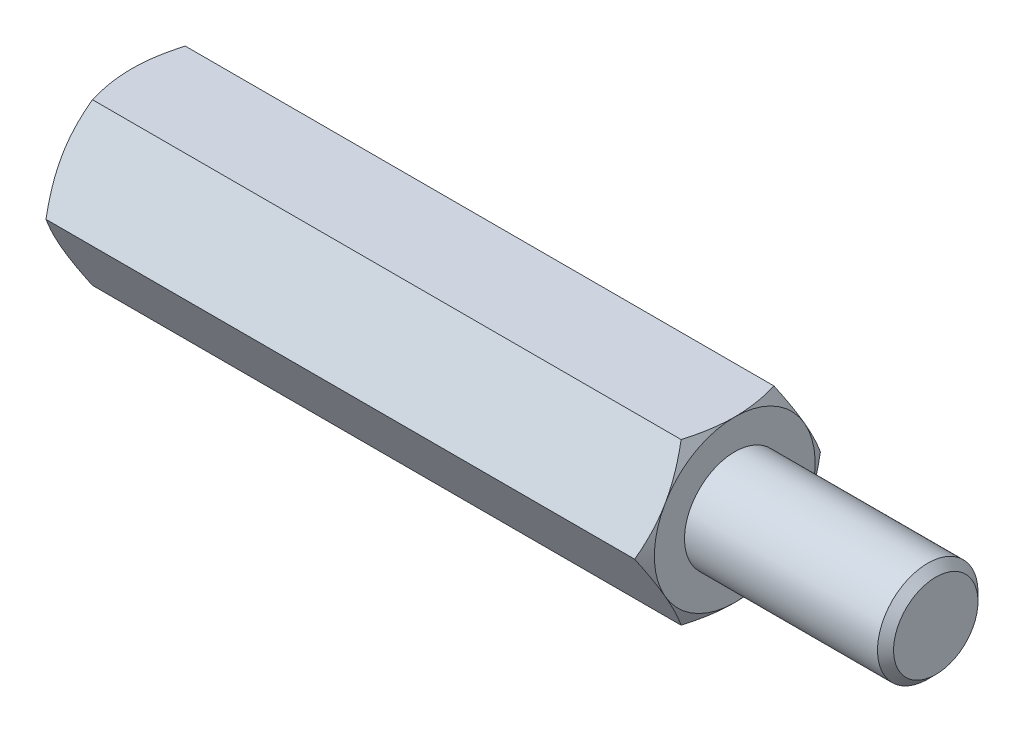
ISO-10303-21;
HEADER;
FILE_DESCRIPTION(('STEP AP214'),'2;1');
FILE_NAME('part.step','',(''),(''),'','','');
FILE_SCHEMA(('AUTOMOTIVE_DESIGN { 1 0 10303 214 1 1 1 1 }'));
ENDSEC;
DATA;
#1=APPLICATION_CONTEXT('core data for automotive mechanical design processes');
#2=APPLICATION_PROTOCOL_DEFINITION('international standard','automotive_design',2000,#1);
#3=PRODUCT_CONTEXT('',#1,'mechanical');
#4=PRODUCT('Part','Part','',(#3));
#5=PRODUCT_RELATED_PRODUCT_CATEGORY('part','',(#4));
#6=PRODUCT_DEFINITION_FORMATION('','',#4);
#7=PRODUCT_DEFINITION_CONTEXT('part definition',#1,'design');
#8=PRODUCT_DEFINITION('design','',#6,#7);
#9=PRODUCT_DEFINITION_SHAPE('','',#8);
#10=(LENGTH_UNIT() NAMED_UNIT(*) SI_UNIT(.MILLI.,.METRE.));
#11=(NAMED_UNIT(*) PLANE_ANGLE_UNIT() SI_UNIT($,.RADIAN.));
#12=(NAMED_UNIT(*) SI_UNIT($,.STERADIAN.) SOLID_ANGLE_UNIT());
#13=UNCERTAINTY_MEASURE_WITH_UNIT(LENGTH_MEASURE(1.E-05),#10,'distance_accuracy_value','');
#14=(GEOMETRIC_REPRESENTATION_CONTEXT(3) GLOBAL_UNCERTAINTY_ASSIGNED_CONTEXT((#13)) GLOBAL_UNIT_ASSIGNED_CONTEXT((#10,
#11,#12)) REPRESENTATION_CONTEXT('',''));
#15=CARTESIAN_POINT('',(0.,0.,0.));
#16=DIRECTION('',(0.,0.,1.));
#17=DIRECTION('',(1.,0.,0.));
#18=AXIS2_PLACEMENT_3D('',#15,#16,#17);
#19=CARTESIAN_POINT('',(15.,4.,-2.3094010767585));
#20=DIRECTION('',(1.,0.,0.));
#21=DIRECTION('',(0.,0.,-1.));
#22=AXIS2_PLACEMENT_3D('',#19,#20,#21);
#23=PLANE('',#22);
#24=CARTESIAN_POINT('',(15.,0.,0.));
#25=DIRECTION('',(1.,0.,0.));
#26=DIRECTION('',(0.,0.,-1.));
#27=AXIS2_PLACEMENT_3D('',#24,#25,#26);
#28=CIRCLE('',#27,4.);
#29=CARTESIAN_POINT('',(15.,-2.,-3.46410161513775));
#30=VERTEX_POINT('',#29);
#31=CARTESIAN_POINT('',(15.,2.,-3.46410161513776));
#32=VERTEX_POINT('',#31);
#33=EDGE_CURVE('E288',#30,#32,#28,.T.);
#34=ORIENTED_EDGE('',*,*,#33,.T.);
#35=CARTESIAN_POINT('',(15.,4.,0.));
#36=VERTEX_POINT('',#35);
#37=EDGE_CURVE('E53',#32,#36,#28,.T.);
#38=ORIENTED_EDGE('',*,*,#37,.T.);
#39=CARTESIAN_POINT('',(15.,2.,3.46410161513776));
#40=VERTEX_POINT('',#39);
#41=EDGE_CURVE('E297',#36,#40,#28,.T.);
#42=ORIENTED_EDGE('',*,*,#41,.T.);
#43=CARTESIAN_POINT('',(15.,-2.,3.46410161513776));
#44=VERTEX_POINT('',#43);
#45=EDGE_CURVE('E303',#40,#44,#28,.T.);
#46=ORIENTED_EDGE('',*,*,#45,.T.);
#47=CARTESIAN_POINT('',(15.,0.,0.));
#48=DIRECTION('',(-1.,0.,0.));
#49=DIRECTION('',(0.,-1.,0.));
#50=AXIS2_PLACEMENT_3D('',#47,#48,#49);
#51=CIRCLE('',#50,4.);
#52=CARTESIAN_POINT('',(15.,-4.00000000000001,0.));
#53=VERTEX_POINT('',#52);
#54=EDGE_CURVE('E193',#53,#44,#51,.T.);
#55=ORIENTED_EDGE('',*,*,#54,.F.);
#56=EDGE_CURVE('E61',#53,#30,#28,.T.);
#57=ORIENTED_EDGE('',*,*,#56,.T.);
#58=EDGE_LOOP('',(#34,#38,#42,#46,#55,#57));
#59=FACE_BOUND('',#58,.T.);
#60=CARTESIAN_POINT('',(15.,0.,0.));
#61=DIRECTION('',(1.,0.,0.));
#62=DIRECTION('',(0.,0.,-1.));
#63=AXIS2_PLACEMENT_3D('',#60,#61,#62);
#64=CIRCLE('',#63,2.5);
#65=CARTESIAN_POINT('',(15.,0.,-2.5));
#66=VERTEX_POINT('',#65);
#67=EDGE_CURVE('E506',#66,#66,#64,.T.);
#68=ORIENTED_EDGE('',*,*,#67,.F.);
#69=EDGE_LOOP('',(#68));
#70=FACE_BOUND('',#69,.T.);
#71=ADVANCED_FACE('F37',(#59,#70),#23,.T.);
#72=CARTESIAN_POINT('',(15.,0.,-4.61880215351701));
#73=DIRECTION('',(0.,-0.5,0.866025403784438));
#74=DIRECTION('',(0.,-0.866025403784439,-0.5));
#75=AXIS2_PLACEMENT_3D('',#72,#73,#74);
#76=PLANE('',#75);
#77=CARTESIAN_POINT('',(14.6426677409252,-0.000200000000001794,-4.61891762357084));
#78=CARTESIAN_POINT('',(14.7012821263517,0.175579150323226,-4.5174314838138));
#79=CARTESIAN_POINT('',(14.7545896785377,0.352875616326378,-4.41506932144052));
#80=CARTESIAN_POINT('',(14.8476383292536,0.710538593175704,-4.2085725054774));
#81=CARTESIAN_POINT('',(14.8873465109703,0.890911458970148,-4.10443418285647));
#82=CARTESIAN_POINT('',(14.9491577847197,1.24942181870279,-3.89744813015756));
#83=CARTESIAN_POINT('',(14.9716722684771,1.42750415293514,-3.79463224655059));
#84=CARTESIAN_POINT('',(14.9985493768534,1.7845067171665,-3.58851671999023));
#85=CARTESIAN_POINT('',(15.0029342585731,1.9634256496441,-3.48521782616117));
#86=CARTESIAN_POINT('',(14.99380992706,2.29774284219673,-3.29219970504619));
#87=CARTESIAN_POINT('',(14.982541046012,2.45319115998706,-3.20245157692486));
#88=CARTESIAN_POINT('',(14.9468260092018,2.76307505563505,-3.02354002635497));
#89=CARTESIAN_POINT('',(14.9223676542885,2.91750956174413,-2.93437722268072));
#90=CARTESIAN_POINT('',(14.8612239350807,3.22803232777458,-2.75509682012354));
#91=CARTESIAN_POINT('',(14.8242793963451,3.3840812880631,-2.6650019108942));
#92=CARTESIAN_POINT('',(14.740429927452,3.69385183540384,-2.48615580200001));
#93=CARTESIAN_POINT('',(14.6935446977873,3.84757739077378,-2.39740231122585));
#94=CARTESIAN_POINT('',(14.6426677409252,4.0002,-2.30928560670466));
#95=B_SPLINE_CURVE_WITH_KNOTS('',3,(#77,#78,#79,#80,#81,#82,#83,#84,#85,#86,#87,#88,#89,#90,#91,
#92,#93,#94),.UNSPECIFIED.,.F.,.F.,(4,2,2,2,2,2,2,2,4),(0.,0.634047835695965,1.26961969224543,
1.88946157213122,2.50854226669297,3.04757825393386,3.58711366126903,4.13861653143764,
4.68903648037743),.UNSPECIFIED.);
#96=CARTESIAN_POINT('',(14.6427344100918,0.,-4.61880215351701));
#97=VERTEX_POINT('',#96);
#98=EDGE_CURVE('E313',#97,#32,#95,.T.);
#99=ORIENTED_EDGE('',*,*,#98,.F.);
#100=DIRECTION('',(-1.,0.,0.));
#101=VECTOR('',#100,1.);
#102=CARTESIAN_POINT('',(15.,0.,-4.61880215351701));
#103=LINE('',#102,#101);
#104=CARTESIAN_POINT('',(-14.6427344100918,0.,-4.61880215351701));
#105=VERTEX_POINT('',#104);
#106=EDGE_CURVE('E264',#97,#105,#103,.T.);
#107=ORIENTED_EDGE('',*,*,#106,.T.);
#108=CARTESIAN_POINT('',(-14.6426677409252,4.0002,-2.30928560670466));
#109=CARTESIAN_POINT('',(-14.7012821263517,3.82442084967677,-2.4107717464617));
#110=CARTESIAN_POINT('',(-14.7545896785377,3.64712438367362,-2.51313390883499));
#111=CARTESIAN_POINT('',(-14.8476383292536,3.28946140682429,-2.71963072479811));
#112=CARTESIAN_POINT('',(-14.8873465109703,3.10908854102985,-2.82376904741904));
#113=CARTESIAN_POINT('',(-14.9491577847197,2.75057818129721,-3.03075510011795));
#114=CARTESIAN_POINT('',(-14.9716722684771,2.57249584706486,-3.13357098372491));
#115=CARTESIAN_POINT('',(-14.9985493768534,2.21549328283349,-3.33968651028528));
#116=CARTESIAN_POINT('',(-15.0029342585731,2.0365743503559,-3.44298540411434));
#117=CARTESIAN_POINT('',(-14.99380992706,1.70225715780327,-3.63600352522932));
#118=CARTESIAN_POINT('',(-14.982541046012,1.54680884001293,-3.72575165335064));
#119=CARTESIAN_POINT('',(-14.9468260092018,1.23692494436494,-3.90466320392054));
#120=CARTESIAN_POINT('',(-14.9223676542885,1.08249043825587,-3.99382600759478));
#121=CARTESIAN_POINT('',(-14.8612239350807,0.771967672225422,-4.17310641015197));
#122=CARTESIAN_POINT('',(-14.8242793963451,0.615918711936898,-4.26320131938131));
#123=CARTESIAN_POINT('',(-14.740429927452,0.30614816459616,-4.4420474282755));
#124=CARTESIAN_POINT('',(-14.6935446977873,0.15242260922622,-4.53080091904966));
#125=CARTESIAN_POINT('',(-14.6426677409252,-0.000200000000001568,-4.61891762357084));
#126=B_SPLINE_CURVE_WITH_KNOTS('',3,(#108,#109,#110,#111,#112,#113,#114,#115,#116,#117,#118,
#119,#120,#121,#122,#123,#124,#125),.UNSPECIFIED.,.F.,.F.,(4,2,2,2,2,2,2,2,4),(0.,
0.634047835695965,1.26961969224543,1.88946157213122,2.50854226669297,3.04757825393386,
3.58711366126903,4.13861653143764,4.68903648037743),.UNSPECIFIED.);
#127=CARTESIAN_POINT('',(-15.,2.,-3.46410161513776));
#128=VERTEX_POINT('',#127);
#129=EDGE_CURVE('E330',#128,#105,#126,.T.);
#130=ORIENTED_EDGE('',*,*,#129,.F.);
#131=CARTESIAN_POINT('',(-14.6427344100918,4.,-2.3094010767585));
#132=VERTEX_POINT('',#131);
#133=EDGE_CURVE('E324',#132,#128,#126,.T.);
#134=ORIENTED_EDGE('',*,*,#133,.F.);
#135=DIRECTION('',(-1.,0.,0.));
#136=VECTOR('',#135,1.);
#137=CARTESIAN_POINT('',(15.,4.,-2.3094010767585));
#138=LINE('',#137,#136);
#139=CARTESIAN_POINT('',(14.642734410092,4.,-2.30940107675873));
#140=VERTEX_POINT('',#139);
#141=EDGE_CURVE('E279',#140,#132,#138,.T.);
#142=ORIENTED_EDGE('',*,*,#141,.F.);
#143=EDGE_CURVE('E229',#32,#140,#95,.T.);
#144=ORIENTED_EDGE('',*,*,#143,.F.);
#145=EDGE_LOOP('',(#99,#107,#130,#134,#142,#144));
#146=FACE_BOUND('',#145,.T.);
#147=ADVANCED_FACE('F148',(#146),#76,.F.);
#148=CARTESIAN_POINT('',(15.,4.,-2.3094010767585));
#149=DIRECTION('',(0.,-1.,0.));
#150=DIRECTION('',(0.,0.,-1.));
#151=AXIS2_PLACEMENT_3D('',#148,#149,#150);
#152=PLANE('',#151);
#153=CARTESIAN_POINT('',(13.0082907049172,4.,-6.28479524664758));
#154=CARTESIAN_POINT('',(13.0937006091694,4.,-6.10939349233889));
#155=CARTESIAN_POINT('',(13.1783148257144,4.,-5.93359774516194));
#156=CARTESIAN_POINT('',(13.3455059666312,4.,-5.58100905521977));
#157=CARTESIAN_POINT('',(13.4280825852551,4.,-5.40421596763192));
#158=CARTESIAN_POINT('',(13.5911508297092,4.,-5.04855089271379));
#159=CARTESIAN_POINT('',(13.6716293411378,4.,-4.86967287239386));
#160=CARTESIAN_POINT('',(13.829400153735,4.,-4.51052237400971));
#161=CARTESIAN_POINT('',(13.906692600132,4.,-4.33024995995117));
#162=CARTESIAN_POINT('',(14.059802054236,4.,-3.96189114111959));
#163=CARTESIAN_POINT('',(14.135480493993,4.,-3.77374683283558));
#164=CARTESIAN_POINT('',(14.2813045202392,4.,-3.39528725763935));
#165=CARTESIAN_POINT('',(14.3514494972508,4.,-3.2049717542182));
#166=CARTESIAN_POINT('',(14.4844245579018,4.,-2.82219775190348));
#167=CARTESIAN_POINT('',(14.5472687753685,4.,-2.62974421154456));
#168=CARTESIAN_POINT('',(14.6636796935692,4.,-2.24207725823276));
#169=CARTESIAN_POINT('',(14.7172492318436,4.,-2.04686470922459));
#170=CARTESIAN_POINT('',(14.8123031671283,4.,-1.65467425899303));
#171=CARTESIAN_POINT('',(14.8538563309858,4.,-1.45771333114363));
#172=CARTESIAN_POINT('',(14.9225903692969,4.,-1.06125849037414));
#173=CARTESIAN_POINT('',(14.9497727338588,4.,-0.861764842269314));
#174=CARTESIAN_POINT('',(14.9872447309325,4.,-0.46387918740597));
#175=CARTESIAN_POINT('',(14.9977578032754,4.,-0.265508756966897));
#176=CARTESIAN_POINT('',(15.0015934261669,4.,0.131417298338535));
#177=CARTESIAN_POINT('',(14.9949158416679,4.,0.329972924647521));
#178=CARTESIAN_POINT('',(14.9696489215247,4.,0.664692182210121));
#179=CARTESIAN_POINT('',(14.9553708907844,4.,0.801202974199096));
#180=CARTESIAN_POINT('',(14.9195349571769,4.,1.07327201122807));
#181=CARTESIAN_POINT('',(14.8979761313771,4.,1.20883013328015));
#182=CARTESIAN_POINT('',(14.8235066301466,4.,1.61386939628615));
#183=CARTESIAN_POINT('',(14.7608149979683,4.,1.88157484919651));
#184=CARTESIAN_POINT('',(14.6515117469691,4.,2.28197262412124));
#185=CARTESIAN_POINT('',(14.612009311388,4.,2.41672443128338));
#186=CARTESIAN_POINT('',(14.5287523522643,4.,2.68492067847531));
#187=CARTESIAN_POINT('',(14.4849977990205,4.,2.81836510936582));
#188=CARTESIAN_POINT('',(14.3939510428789,4.,3.0839859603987));
#189=CARTESIAN_POINT('',(14.346659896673,4.,3.21616274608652));
#190=CARTESIAN_POINT('',(14.2491111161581,4.,3.47941134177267));
#191=CARTESIAN_POINT('',(14.1988535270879,4.,3.61048316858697));
#192=CARTESIAN_POINT('',(14.0713295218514,4.,3.93385125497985));
#193=CARTESIAN_POINT('',(13.9926014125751,4.,4.12557021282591));
#194=CARTESIAN_POINT('',(13.8309693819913,4.,4.50724553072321));
#195=CARTESIAN_POINT('',(13.7480651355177,4.,4.69720175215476));
#196=CARTESIAN_POINT('',(13.5789699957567,4.,5.07569950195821));
#197=CARTESIAN_POINT('',(13.4927782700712,4.,5.26424065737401));
#198=CARTESIAN_POINT('',(13.3178011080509,4.,5.64011758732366));
#199=CARTESIAN_POINT('',(13.2290156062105,4.,5.82745333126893));
#200=CARTESIAN_POINT('',(12.9593432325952,4.,6.38844423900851));
#201=CARTESIAN_POINT('',(12.7753561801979,4.,6.76060781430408));
#202=CARTESIAN_POINT('',(12.4019562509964,4.,7.50211228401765));
#203=CARTESIAN_POINT('',(12.2125442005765,4.,7.87145359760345));
#204=CARTESIAN_POINT('',(11.8473877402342,4.,8.57450173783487));
#205=CARTESIAN_POINT('',(11.671975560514,4.,8.90838144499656));
#206=CARTESIAN_POINT('',(11.3188097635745,4.,9.57491712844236));
#207=CARTESIAN_POINT('',(11.1410560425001,4.,9.90757304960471));
#208=CARTESIAN_POINT('',(10.7842933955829,4.,10.5709822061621));
#209=CARTESIAN_POINT('',(10.6052895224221,3.99999999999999,10.9017381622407));
#210=CARTESIAN_POINT('',(10.2459071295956,3.99999999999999,11.5624752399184));
#211=CARTESIAN_POINT('',(10.0655286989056,3.99999999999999,11.8924564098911));
#212=CARTESIAN_POINT('',(9.88464248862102,3.99999999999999,12.2221569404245));
#213=B_SPLINE_CURVE_WITH_KNOTS('',3,(#153,#154,#155,#156,#157,#158,#159,#160,#161,#162,#163,
#164,#165,#166,#167,#168,#169,#170,#171,#172,#173,#174,#175,#176,#177,#178,#179,#180,#181,#182,
#183,#184,#185,#186,#187,#188,#189,#190,#191,#192,#193,#194,#195,#196,#197,#198,#199,#200,#201,
#202,#203,#204,#205,#206,#207,#208,#209,#210,#211,#212),.UNSPECIFIED.,.F.,.F.,(4,2,2,2,2,2,2,2,
2,2,2,2,2,2,2,2,2,2,2,2,2,2,2,2,2,2,2,2,2,4),(0.,0.585280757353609,1.17064881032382,
1.75906864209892,2.34746162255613,2.9557770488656,3.56415938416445,4.17134357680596,
4.77834167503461,5.38179402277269,5.98518378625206,6.58041501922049,7.17565092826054,
7.5872191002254,7.99883946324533,8.82250155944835,9.24373134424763,9.66496407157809,
10.086071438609,10.5071723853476,11.1288656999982,11.7506074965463,12.3725077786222,
12.9944237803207,14.2398211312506,15.4850297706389,16.6164791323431,17.7479788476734,
18.8762380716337,20.0044248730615),.UNSPECIFIED.);
#214=EDGE_CURVE('E227',#140,#36,#213,.T.);
#215=ORIENTED_EDGE('',*,*,#214,.F.);
#216=ORIENTED_EDGE('',*,*,#141,.T.);
#217=CARTESIAN_POINT('',(-13.0082907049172,4.,-6.28479524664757));
#218=CARTESIAN_POINT('',(-13.0937006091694,4.,-6.10939349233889));
#219=CARTESIAN_POINT('',(-13.1783148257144,4.,-5.93359774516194));
#220=CARTESIAN_POINT('',(-13.3455059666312,4.,-5.58100905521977));
#221=CARTESIAN_POINT('',(-13.4280825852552,4.,-5.40421596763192));
#222=CARTESIAN_POINT('',(-13.5911508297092,4.,-5.04855089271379));
#223=CARTESIAN_POINT('',(-13.6716293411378,4.,-4.86967287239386));
#224=CARTESIAN_POINT('',(-13.829400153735,4.,-4.51052237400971));
#225=CARTESIAN_POINT('',(-13.906692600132,4.,-4.33024995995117));
#226=CARTESIAN_POINT('',(-14.059802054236,4.,-3.96189114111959));
#227=CARTESIAN_POINT('',(-14.135480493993,4.,-3.77374683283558));
#228=CARTESIAN_POINT('',(-14.2813045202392,4.,-3.39528725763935));
#229=CARTESIAN_POINT('',(-14.3514494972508,4.,-3.2049717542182));
#230=CARTESIAN_POINT('',(-14.4844245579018,4.,-2.82219775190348));
#231=CARTESIAN_POINT('',(-14.5472687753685,4.,-2.62974421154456));
#232=CARTESIAN_POINT('',(-14.6636796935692,4.,-2.24207725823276));
#233=CARTESIAN_POINT('',(-14.7172492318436,4.,-2.04686470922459));
#234=CARTESIAN_POINT('',(-14.8123031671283,4.,-1.65467425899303));
#235=CARTESIAN_POINT('',(-14.8538563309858,4.,-1.45771333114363));
#236=CARTESIAN_POINT('',(-14.9225903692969,4.,-1.06125849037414));
#237=CARTESIAN_POINT('',(-14.9497727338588,4.,-0.861764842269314));
#238=CARTESIAN_POINT('',(-14.9872447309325,4.,-0.46387918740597));
#239=CARTESIAN_POINT('',(-14.9977578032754,4.,-0.265508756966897));
#240=CARTESIAN_POINT('',(-15.0015934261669,4.,0.131417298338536));
#241=CARTESIAN_POINT('',(-14.9949158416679,4.,0.329972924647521));
#242=CARTESIAN_POINT('',(-14.9696489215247,4.,0.66469218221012));
#243=CARTESIAN_POINT('',(-14.9553708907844,4.,0.801202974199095));
#244=CARTESIAN_POINT('',(-14.9195349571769,4.,1.07327201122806));
#245=CARTESIAN_POINT('',(-14.8979761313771,4.,1.20883013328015));
#246=CARTESIAN_POINT('',(-14.8235066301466,4.,1.61386939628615));
#247=CARTESIAN_POINT('',(-14.7608149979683,4.,1.8815748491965));
#248=CARTESIAN_POINT('',(-14.6515117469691,4.,2.28197262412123));
#249=CARTESIAN_POINT('',(-14.612009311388,4.,2.41672443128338));
#250=CARTESIAN_POINT('',(-14.5287523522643,4.,2.68492067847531));
#251=CARTESIAN_POINT('',(-14.4849977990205,4.,2.81836510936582));
#252=CARTESIAN_POINT('',(-14.3939510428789,4.,3.0839859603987));
#253=CARTESIAN_POINT('',(-14.346659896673,4.,3.21616274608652));
#254=CARTESIAN_POINT('',(-14.2491111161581,4.,3.47941134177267));
#255=CARTESIAN_POINT('',(-14.1988535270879,4.,3.61048316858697));
#256=CARTESIAN_POINT('',(-14.0713295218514,4.,3.93385125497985));
#257=CARTESIAN_POINT('',(-13.9926014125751,4.,4.12557021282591));
#258=CARTESIAN_POINT('',(-13.8309693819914,4.,4.50724553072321));
#259=CARTESIAN_POINT('',(-13.7480651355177,4.,4.69720175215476));
#260=CARTESIAN_POINT('',(-13.5789699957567,4.,5.0756995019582));
#261=CARTESIAN_POINT('',(-13.4927782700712,4.,5.26424065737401));
#262=CARTESIAN_POINT('',(-13.3178011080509,4.,5.64011758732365));
#263=CARTESIAN_POINT('',(-13.2290156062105,4.,5.82745333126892));
#264=CARTESIAN_POINT('',(-12.9593432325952,4.,6.3884442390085));
#265=CARTESIAN_POINT('',(-12.7753561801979,4.,6.76060781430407));
#266=CARTESIAN_POINT('',(-12.4019562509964,4.,7.50211228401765));
#267=CARTESIAN_POINT('',(-12.2125442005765,4.,7.87145359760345));
#268=CARTESIAN_POINT('',(-11.8473877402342,4.,8.57450173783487));
#269=CARTESIAN_POINT('',(-11.671975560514,4.,8.90838144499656));
#270=CARTESIAN_POINT('',(-11.3188097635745,4.,9.57491712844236));
#271=CARTESIAN_POINT('',(-11.1410560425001,4.,9.90757304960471));
#272=CARTESIAN_POINT('',(-10.7842933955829,4.,10.5709822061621));
#273=CARTESIAN_POINT('',(-10.6052895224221,3.99999999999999,10.9017381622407));
#274=CARTESIAN_POINT('',(-10.2459071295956,3.99999999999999,11.5624752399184));
#275=CARTESIAN_POINT('',(-10.0655286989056,3.99999999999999,11.8924564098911));
#276=CARTESIAN_POINT('',(-9.88464248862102,3.99999999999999,12.2221569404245));
#277=B_SPLINE_CURVE_WITH_KNOTS('',3,(#217,#218,#219,#220,#221,#222,#223,#224,#225,#226,#227,
#228,#229,#230,#231,#232,#233,#234,#235,#236,#237,#238,#239,#240,#241,#242,#243,#244,#245,#246,
#247,#248,#249,#250,#251,#252,#253,#254,#255,#256,#257,#258,#259,#260,#261,#262,#263,#264,#265,
#266,#267,#268,#269,#270,#271,#272,#273,#274,#275,#276),.UNSPECIFIED.,.F.,.F.,(4,2,2,2,2,2,2,2,
2,2,2,2,2,2,2,2,2,2,2,2,2,2,2,2,2,2,2,2,2,4),(0.,0.585280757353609,1.17064881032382,
1.75906864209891,2.34746162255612,2.95577704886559,3.56415938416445,4.17134357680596,
4.7783416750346,5.38179402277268,5.98518378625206,6.58041501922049,7.17565092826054,
7.5872191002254,7.99883946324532,8.82250155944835,9.24373134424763,9.66496407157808,
10.086071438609,10.5071723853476,11.1288656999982,11.7506074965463,12.3725077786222,
12.9944237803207,14.2398211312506,15.4850297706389,16.6164791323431,17.7479788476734,
18.8762380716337,20.0044248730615),.UNSPECIFIED.);
#278=CARTESIAN_POINT('',(-15.,4.,0.));
#279=VERTEX_POINT('',#278);
#280=EDGE_CURVE('E241',#279,#132,#277,.F.);
#281=ORIENTED_EDGE('',*,*,#280,.F.);
#282=CARTESIAN_POINT('',(-14.6427344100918,4.,2.3094010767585));
#283=VERTEX_POINT('',#282);
#284=EDGE_CURVE('E249',#283,#279,#277,.F.);
#285=ORIENTED_EDGE('',*,*,#284,.F.);
#286=DIRECTION('',(-1.,0.,0.));
#287=VECTOR('',#286,1.);
#288=CARTESIAN_POINT('',(15.,4.,2.3094010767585));
#289=LINE('',#288,#287);
#290=CARTESIAN_POINT('',(14.6427344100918,4.,2.3094010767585));
#291=VERTEX_POINT('',#290);
#292=EDGE_CURVE('E276',#291,#283,#289,.T.);
#293=ORIENTED_EDGE('',*,*,#292,.F.);
#294=EDGE_CURVE('E221',#36,#291,#213,.T.);
#295=ORIENTED_EDGE('',*,*,#294,.F.);
#296=EDGE_LOOP('',(#215,#216,#281,#285,#293,#295));
#297=FACE_BOUND('',#296,.T.);
#298=ADVANCED_FACE('F153',(#297),#152,.F.);
#299=CARTESIAN_POINT('',(15.,4.,2.3094010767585));
#300=DIRECTION('',(0.,-0.5,-0.866025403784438));
#301=DIRECTION('',(0.,0.866025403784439,-0.5));
#302=AXIS2_PLACEMENT_3D('',#299,#300,#301);
#303=PLANE('',#302);
#304=CARTESIAN_POINT('',(14.6426677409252,4.0002,2.30928560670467));
#305=CARTESIAN_POINT('',(14.7012821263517,3.82442084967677,2.4107717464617));
#306=CARTESIAN_POINT('',(14.7545896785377,3.64712438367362,2.51313390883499));
#307=CARTESIAN_POINT('',(14.8476383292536,3.28946140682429,2.71963072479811));
#308=CARTESIAN_POINT('',(14.8873465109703,3.10908854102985,2.82376904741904));
#309=CARTESIAN_POINT('',(14.9491577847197,2.75057818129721,3.03075510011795));
#310=CARTESIAN_POINT('',(14.9716722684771,2.57249584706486,3.13357098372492));
#311=CARTESIAN_POINT('',(14.9985493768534,2.21549328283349,3.33968651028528));
#312=CARTESIAN_POINT('',(15.0029342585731,2.0365743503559,3.44298540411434));
#313=CARTESIAN_POINT('',(14.99380992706,1.70225715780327,3.63600352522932));
#314=CARTESIAN_POINT('',(14.982541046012,1.54680884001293,3.72575165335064));
#315=CARTESIAN_POINT('',(14.9468260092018,1.23692494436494,3.90466320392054));
#316=CARTESIAN_POINT('',(14.9223676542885,1.08249043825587,3.99382600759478));
#317=CARTESIAN_POINT('',(14.8612239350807,0.771967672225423,4.17310641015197));
#318=CARTESIAN_POINT('',(14.8242793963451,0.615918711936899,4.26320131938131));
#319=CARTESIAN_POINT('',(14.740429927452,0.306148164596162,4.4420474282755));
#320=CARTESIAN_POINT('',(14.6935446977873,0.152422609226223,4.53080091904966));
#321=CARTESIAN_POINT('',(14.6426677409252,-0.000199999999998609,4.61891762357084));
#322=B_SPLINE_CURVE_WITH_KNOTS('',3,(#304,#305,#306,#307,#308,#309,#310,#311,#312,#313,#314,
#315,#316,#317,#318,#319,#320,#321),.UNSPECIFIED.,.F.,.F.,(4,2,2,2,2,2,2,2,4),(0.,
0.634047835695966,1.26961969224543,1.88946157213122,2.50854226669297,3.04757825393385,
3.58711366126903,4.13861653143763,4.68903648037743),.UNSPECIFIED.);
#323=EDGE_CURVE('E228',#291,#40,#322,.T.);
#324=ORIENTED_EDGE('',*,*,#323,.F.);
#325=ORIENTED_EDGE('',*,*,#292,.T.);
#326=CARTESIAN_POINT('',(-14.6426677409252,-0.000199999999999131,4.61891762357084));
#327=CARTESIAN_POINT('',(-14.7012821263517,0.175579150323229,4.5174314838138));
#328=CARTESIAN_POINT('',(-14.7545896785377,0.352875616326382,4.41506932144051));
#329=CARTESIAN_POINT('',(-14.8476383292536,0.710538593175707,4.20857250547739));
#330=CARTESIAN_POINT('',(-14.8873465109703,0.89091145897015,4.10443418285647));
#331=CARTESIAN_POINT('',(-14.9491577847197,1.24942181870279,3.89744813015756));
#332=CARTESIAN_POINT('',(-14.9716722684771,1.42750415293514,3.79463224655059));
#333=CARTESIAN_POINT('',(-14.9985493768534,1.78450671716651,3.58851671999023));
#334=CARTESIAN_POINT('',(-15.0029342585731,1.9634256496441,3.48521782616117));
#335=CARTESIAN_POINT('',(-14.99380992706,2.29774284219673,3.29219970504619));
#336=CARTESIAN_POINT('',(-14.982541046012,2.45319115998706,3.20245157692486));
#337=CARTESIAN_POINT('',(-14.9468260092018,2.76307505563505,3.02354002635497));
#338=CARTESIAN_POINT('',(-14.9223676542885,2.91750956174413,2.93437722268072));
#339=CARTESIAN_POINT('',(-14.8612239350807,3.22803232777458,2.75509682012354));
#340=CARTESIAN_POINT('',(-14.8242793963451,3.3840812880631,2.6650019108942));
#341=CARTESIAN_POINT('',(-14.740429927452,3.69385183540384,2.48615580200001));
#342=CARTESIAN_POINT('',(-14.6935446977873,3.84757739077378,2.39740231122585));
#343=CARTESIAN_POINT('',(-14.6426677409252,4.0002,2.30928560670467));
#344=B_SPLINE_CURVE_WITH_KNOTS('',3,(#326,#327,#328,#329,#330,#331,#332,#333,#334,#335,#336,
#337,#338,#339,#340,#341,#342,#343),.UNSPECIFIED.,.F.,.F.,(4,2,2,2,2,2,2,2,4),(0.,
0.634047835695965,1.26961969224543,1.88946157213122,2.50854226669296,3.04757825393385,
3.58711366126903,4.13861653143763,4.68903648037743),.UNSPECIFIED.);
#345=CARTESIAN_POINT('',(-15.,2.,3.46410161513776));
#346=VERTEX_POINT('',#345);
#347=EDGE_CURVE('E255',#346,#283,#344,.T.);
#348=ORIENTED_EDGE('',*,*,#347,.F.);
#349=CARTESIAN_POINT('',(-14.6427344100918,0.,4.618802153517));
#350=VERTEX_POINT('',#349);
#351=EDGE_CURVE('E262',#350,#346,#344,.T.);
#352=ORIENTED_EDGE('',*,*,#351,.F.);
#353=DIRECTION('',(-1.,0.,0.));
#354=VECTOR('',#353,1.);
#355=CARTESIAN_POINT('',(15.,0.,4.618802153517));
#356=LINE('',#355,#354);
#357=CARTESIAN_POINT('',(14.6427344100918,0.,4.618802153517));
#358=VERTEX_POINT('',#357);
#359=EDGE_CURVE('E273',#358,#350,#356,.T.);
#360=ORIENTED_EDGE('',*,*,#359,.F.);
#361=EDGE_CURVE('E215',#40,#358,#322,.T.);
#362=ORIENTED_EDGE('',*,*,#361,.F.);
#363=EDGE_LOOP('',(#324,#325,#348,#352,#360,#362));
#364=FACE_BOUND('',#363,.T.);
#365=ADVANCED_FACE('F235',(#364),#303,.F.);
#366=CARTESIAN_POINT('',(15.,0.,4.618802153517));
#367=DIRECTION('',(0.,0.5,-0.866025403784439));
#368=DIRECTION('',(0.,0.866025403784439,0.5));
#369=AXIS2_PLACEMENT_3D('',#366,#367,#368);
#370=PLANE('',#369);
#371=CARTESIAN_POINT('',(14.6426677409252,0.000200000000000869,4.61891762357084));
#372=CARTESIAN_POINT('',(14.7012821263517,-0.175579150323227,4.5174314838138));
#373=CARTESIAN_POINT('',(14.7545896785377,-0.35287561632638,4.41506932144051));
#374=CARTESIAN_POINT('',(14.8476383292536,-0.710538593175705,4.20857250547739));
#375=CARTESIAN_POINT('',(14.8873465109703,-0.890911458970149,4.10443418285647));
#376=CARTESIAN_POINT('',(14.9491577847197,-1.24942181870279,3.89744813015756));
#377=CARTESIAN_POINT('',(14.9716722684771,-1.42750415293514,3.79463224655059));
#378=CARTESIAN_POINT('',(14.9985493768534,-1.7845067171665,3.58851671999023));
#379=CARTESIAN_POINT('',(15.0029342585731,-1.9634256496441,3.48521782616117));
#380=CARTESIAN_POINT('',(14.99380992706,-2.29774284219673,3.29219970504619));
#381=CARTESIAN_POINT('',(14.982541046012,-2.45319115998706,3.20245157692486));
#382=CARTESIAN_POINT('',(14.9468260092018,-2.76307505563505,3.02354002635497));
#383=CARTESIAN_POINT('',(14.9223676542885,-2.91750956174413,2.93437722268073));
#384=CARTESIAN_POINT('',(14.8612239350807,-3.22803232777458,2.75509682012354));
#385=CARTESIAN_POINT('',(14.8242793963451,-3.3840812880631,2.6650019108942));
#386=CARTESIAN_POINT('',(14.740429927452,-3.69385183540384,2.48615580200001));
#387=CARTESIAN_POINT('',(14.6935446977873,-3.84757739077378,2.39740231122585));
#388=CARTESIAN_POINT('',(14.6426677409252,-4.0002,2.30928560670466));
#389=B_SPLINE_CURVE_WITH_KNOTS('',3,(#371,#372,#373,#374,#375,#376,#377,#378,#379,#380,#381,
#382,#383,#384,#385,#386,#387,#388),.UNSPECIFIED.,.F.,.F.,(4,2,2,2,2,2,2,2,4),(0.,
0.634047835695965,1.26961969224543,1.88946157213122,2.50854226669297,3.04757825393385,
3.58711366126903,4.13861653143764,4.68903648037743),.UNSPECIFIED.);
#390=EDGE_CURVE('E314',#358,#44,#389,.T.);
#391=ORIENTED_EDGE('',*,*,#390,.F.);
#392=ORIENTED_EDGE('',*,*,#359,.T.);
#393=CARTESIAN_POINT('',(-14.6426677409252,-4.0002,2.30928560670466));
#394=CARTESIAN_POINT('',(-14.7012821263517,-3.82442084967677,2.4107717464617));
#395=CARTESIAN_POINT('',(-14.7545896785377,-3.64712438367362,2.51313390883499));
#396=CARTESIAN_POINT('',(-14.8476383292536,-3.28946140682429,2.71963072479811));
#397=CARTESIAN_POINT('',(-14.8873465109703,-3.10908854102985,2.82376904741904));
#398=CARTESIAN_POINT('',(-14.9491577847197,-2.75057818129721,3.03075510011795));
#399=CARTESIAN_POINT('',(-14.9716722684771,-2.57249584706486,3.13357098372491));
#400=CARTESIAN_POINT('',(-14.9985493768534,-2.21549328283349,3.33968651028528));
#401=CARTESIAN_POINT('',(-15.0029342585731,-2.0365743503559,3.44298540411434));
#402=CARTESIAN_POINT('',(-14.99380992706,-1.70225715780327,3.63600352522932));
#403=CARTESIAN_POINT('',(-14.982541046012,-1.54680884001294,3.72575165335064));
#404=CARTESIAN_POINT('',(-14.9468260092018,-1.23692494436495,3.90466320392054));
#405=CARTESIAN_POINT('',(-14.9223676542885,-1.08249043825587,3.99382600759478));
#406=CARTESIAN_POINT('',(-14.8612239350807,-0.771967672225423,4.17310641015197));
#407=CARTESIAN_POINT('',(-14.8242793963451,-0.615918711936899,4.26320131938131));
#408=CARTESIAN_POINT('',(-14.740429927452,-0.30614816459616,4.4420474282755));
#409=CARTESIAN_POINT('',(-14.6935446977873,-0.15242260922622,4.53080091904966));
#410=CARTESIAN_POINT('',(-14.6426677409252,0.000200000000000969,4.61891762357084));
#411=B_SPLINE_CURVE_WITH_KNOTS('',3,(#393,#394,#395,#396,#397,#398,#399,#400,#401,#402,#403,
#404,#405,#406,#407,#408,#409,#410),.UNSPECIFIED.,.F.,.F.,(4,2,2,2,2,2,2,2,4),(0.,
0.634047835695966,1.26961969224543,1.88946157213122,2.50854226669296,3.04757825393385,
3.58711366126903,4.13861653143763,4.68903648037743),.UNSPECIFIED.);
#412=CARTESIAN_POINT('',(-15.,-2.,3.46410161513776));
#413=VERTEX_POINT('',#412);
#414=EDGE_CURVE('E263',#413,#350,#411,.T.);
#415=ORIENTED_EDGE('',*,*,#414,.F.);
#416=CARTESIAN_POINT('',(-14.6427344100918,-4.,2.3094010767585));
#417=VERTEX_POINT('',#416);
#418=EDGE_CURVE('E250',#417,#413,#411,.T.);
#419=ORIENTED_EDGE('',*,*,#418,.F.);
#420=DIRECTION('',(-1.,0.,0.));
#421=VECTOR('',#420,1.);
#422=CARTESIAN_POINT('',(15.,-4.,2.3094010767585));
#423=LINE('',#422,#421);
#424=CARTESIAN_POINT('',(14.6427344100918,-4.,2.3094010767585));
#425=VERTEX_POINT('',#424);
#426=EDGE_CURVE('E270',#425,#417,#423,.T.);
#427=ORIENTED_EDGE('',*,*,#426,.F.);
#428=EDGE_CURVE('E210',#44,#425,#389,.T.);
#429=ORIENTED_EDGE('',*,*,#428,.F.);
#430=EDGE_LOOP('',(#391,#392,#415,#419,#427,#429));
#431=FACE_BOUND('',#430,.T.);
#432=ADVANCED_FACE('F389',(#431),#370,.F.);
#433=CARTESIAN_POINT('',(15.,-4.,2.3094010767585));
#434=DIRECTION('',(0.,1.,0.));
#435=DIRECTION('',(0.,0.,1.));
#436=AXIS2_PLACEMENT_3D('',#433,#434,#435);
#437=PLANE('',#436);
#438=CARTESIAN_POINT('',(13.0082907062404,-4.,-6.28479524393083));
#439=CARTESIAN_POINT('',(13.0937006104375,-4.,-6.10939348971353));
#440=CARTESIAN_POINT('',(13.1783148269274,-4.,-5.93359774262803));
#441=CARTESIAN_POINT('',(13.3455059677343,-4.,-5.58100905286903));
#442=CARTESIAN_POINT('',(13.4280825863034,-4.,-5.40421596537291));
#443=CARTESIAN_POINT('',(13.5911508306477,-4.,-5.04855089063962));
#444=CARTESIAN_POINT('',(13.6716293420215,-4.,-4.8696728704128));
#445=CARTESIAN_POINT('',(13.8294001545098,-4.,-4.51052237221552));
#446=CARTESIAN_POINT('',(13.9066926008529,-4.,-4.33024995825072));
#447=CARTESIAN_POINT('',(14.0598020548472,-4.,-3.96189113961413));
#448=CARTESIAN_POINT('',(14.1354804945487,-4.,-3.77374683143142));
#449=CARTESIAN_POINT('',(14.2813045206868,-4.,-3.39528725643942));
#450=CARTESIAN_POINT('',(14.3514494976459,-4.,-3.20497175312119));
#451=CARTESIAN_POINT('',(14.4844245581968,-4.,-2.82219775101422));
#452=CARTESIAN_POINT('',(14.5472687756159,-4.,-2.62974421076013));
#453=CARTESIAN_POINT('',(14.6636796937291,-4.,-2.24207725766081));
#454=CARTESIAN_POINT('',(14.7172492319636,-4.,-2.04686470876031));
#455=CARTESIAN_POINT('',(14.8123031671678,-4.,-1.65467425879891));
#456=CARTESIAN_POINT('',(14.8538563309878,-4.,-1.45771333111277));
#457=CARTESIAN_POINT('',(14.9225903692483,-4.,-1.06125849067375));
#458=CARTESIAN_POINT('',(14.9497727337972,-4.,-0.861764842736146));
#459=CARTESIAN_POINT('',(14.9872447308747,-4.,-0.463879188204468));
#460=CARTESIAN_POINT('',(14.9977578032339,-4.,-0.265508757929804));
#461=CARTESIAN_POINT('',(15.0015934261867,-4.,0.131417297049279));
#462=CARTESIAN_POINT('',(14.9949158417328,-4.,0.329972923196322));
#463=CARTESIAN_POINT('',(14.9696489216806,-4.,0.664692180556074));
#464=CARTESIAN_POINT('',(14.9553708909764,-4.,0.801202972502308));
#465=CARTESIAN_POINT('',(14.9195349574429,-4.,1.07327200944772));
#466=CARTESIAN_POINT('',(14.8979761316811,-4.,1.20883013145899));
#467=CARTESIAN_POINT('',(14.8235066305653,-4.,1.6138693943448));
#468=CARTESIAN_POINT('',(14.7608149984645,-4.,1.88157484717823));
#469=CARTESIAN_POINT('',(14.6515117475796,-4.,2.28197262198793));
#470=CARTESIAN_POINT('',(14.6120093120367,-4.,2.41672442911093));
#471=CARTESIAN_POINT('',(14.5287523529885,-4.,2.68492067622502));
#472=CARTESIAN_POINT('',(14.4849977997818,-4.,2.81836510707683));
#473=CARTESIAN_POINT('',(14.3939510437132,-4.,3.0839859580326));
#474=CARTESIAN_POINT('',(14.3466598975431,-4.,3.21616274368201));
#475=CARTESIAN_POINT('',(14.2491111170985,-4.,3.47941133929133));
#476=CARTESIAN_POINT('',(14.1988535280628,-4.,3.61048316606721));
#477=CARTESIAN_POINT('',(14.0713295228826,-4.,3.93385125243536));
#478=CARTESIAN_POINT('',(13.9926014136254,-4.,4.12557021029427));
#479=CARTESIAN_POINT('',(13.830969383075,-4.,4.50724552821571));
#480=CARTESIAN_POINT('',(13.7480651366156,-4.,4.69720174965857));
#481=CARTESIAN_POINT('',(13.5789699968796,-4.,5.07569949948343));
#482=CARTESIAN_POINT('',(13.4927782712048,-4.,5.26424065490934));
#483=CARTESIAN_POINT('',(13.3178011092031,-4.,5.64011758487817));
#484=CARTESIAN_POINT('',(13.2290156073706,-4.,5.82745332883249));
#485=CARTESIAN_POINT('',(12.9593432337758,-4.,6.38844423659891));
#486=CARTESIAN_POINT('',(12.775356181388,-4.,6.76060781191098));
#487=CARTESIAN_POINT('',(12.4019562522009,-4.,7.50211228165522));
#488=CARTESIAN_POINT('',(12.2125442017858,-4.,7.87145359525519));
#489=CARTESIAN_POINT('',(11.8473877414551,-4.,8.57450173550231));
#490=CARTESIAN_POINT('',(11.671975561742,-4.,8.90838144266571));
#491=CARTESIAN_POINT('',(11.3188097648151,-4.,9.5749171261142));
#492=CARTESIAN_POINT('',(11.1410560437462,-4.,9.90757304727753));
#493=CARTESIAN_POINT('',(10.78429339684,-4.,10.5709822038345));
#494=CARTESIAN_POINT('',(10.6052895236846,-4.,10.9017381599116));
#495=CARTESIAN_POINT('',(10.2459071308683,-4.,11.562475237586));
#496=CARTESIAN_POINT('',(10.065528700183,-4.,11.8924564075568));
#497=CARTESIAN_POINT('',(9.88464248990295,-4.,12.2221569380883));
#498=B_SPLINE_CURVE_WITH_KNOTS('',3,(#438,#439,#440,#441,#442,#443,#444,#445,#446,#447,#448,
#449,#450,#451,#452,#453,#454,#455,#456,#457,#458,#459,#460,#461,#462,#463,#464,#465,#466,#467,
#468,#469,#470,#471,#472,#473,#474,#475,#476,#477,#478,#479,#480,#481,#482,#483,#484,#485,#486,
#487,#488,#489,#490,#491,#492,#493,#494,#495,#496,#497),.UNSPECIFIED.,.F.,.F.,(4,2,2,2,2,2,2,2,
2,2,2,2,2,2,2,2,2,2,2,2,2,2,2,2,2,2,2,2,2,4),(0.,0.585280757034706,1.17064880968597,
1.75906864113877,2.34746162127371,2.95577704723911,3.56415938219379,4.17134357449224,
4.77834167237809,5.38179401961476,5.98518378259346,6.58041501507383,7.17565092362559,
7.5872190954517,7.99883945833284,8.82250155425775,9.24373133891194,9.6649640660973,
10.0860714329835,10.5071723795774,11.1288656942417,11.7506074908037,12.3725077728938,
12.9944237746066,14.2398211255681,15.4850297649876,16.6164791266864,17.7479788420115,
18.8762380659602,20.0044248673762),.UNSPECIFIED.);
#499=EDGE_CURVE('E386',#425,#53,#498,.F.);
#500=ORIENTED_EDGE('',*,*,#499,.F.);
#501=ORIENTED_EDGE('',*,*,#426,.T.);
#502=CARTESIAN_POINT('',(-13.0082907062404,-4.,-6.28479524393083));
#503=CARTESIAN_POINT('',(-13.0937006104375,-4.,-6.10939348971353));
#504=CARTESIAN_POINT('',(-13.1783148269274,-4.,-5.93359774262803));
#505=CARTESIAN_POINT('',(-13.3455059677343,-4.,-5.58100905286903));
#506=CARTESIAN_POINT('',(-13.4280825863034,-4.,-5.40421596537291));
#507=CARTESIAN_POINT('',(-13.5911508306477,-4.,-5.04855089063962));
#508=CARTESIAN_POINT('',(-13.6716293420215,-4.,-4.8696728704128));
#509=CARTESIAN_POINT('',(-13.8294001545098,-4.,-4.51052237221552));
#510=CARTESIAN_POINT('',(-13.9066926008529,-4.,-4.33024995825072));
#511=CARTESIAN_POINT('',(-14.0598020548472,-4.,-3.96189113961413));
#512=CARTESIAN_POINT('',(-14.1354804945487,-4.,-3.77374683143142));
#513=CARTESIAN_POINT('',(-14.2813045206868,-4.,-3.39528725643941));
#514=CARTESIAN_POINT('',(-14.3514494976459,-4.,-3.20497175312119));
#515=CARTESIAN_POINT('',(-14.4844245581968,-4.,-2.82219775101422));
#516=CARTESIAN_POINT('',(-14.5472687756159,-4.,-2.62974421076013));
#517=CARTESIAN_POINT('',(-14.6636796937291,-4.,-2.24207725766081));
#518=CARTESIAN_POINT('',(-14.7172492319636,-4.,-2.04686470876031));
#519=CARTESIAN_POINT('',(-14.8123031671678,-4.,-1.65467425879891));
#520=CARTESIAN_POINT('',(-14.8538563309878,-4.,-1.45771333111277));
#521=CARTESIAN_POINT('',(-14.9225903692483,-4.,-1.06125849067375));
#522=CARTESIAN_POINT('',(-14.9497727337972,-4.,-0.861764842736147));
#523=CARTESIAN_POINT('',(-14.9872447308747,-4.,-0.463879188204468));
#524=CARTESIAN_POINT('',(-14.9977578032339,-4.,-0.265508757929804));
#525=CARTESIAN_POINT('',(-15.0015934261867,-4.,0.131417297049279));
#526=CARTESIAN_POINT('',(-14.9949158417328,-4.,0.329972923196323));
#527=CARTESIAN_POINT('',(-14.9696489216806,-4.,0.664692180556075));
#528=CARTESIAN_POINT('',(-14.9553708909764,-4.,0.801202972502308));
#529=CARTESIAN_POINT('',(-14.9195349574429,-4.,1.07327200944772));
#530=CARTESIAN_POINT('',(-14.8979761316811,-4.,1.20883013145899));
#531=CARTESIAN_POINT('',(-14.8235066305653,-4.,1.6138693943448));
#532=CARTESIAN_POINT('',(-14.7608149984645,-4.,1.88157484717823));
#533=CARTESIAN_POINT('',(-14.6515117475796,-4.,2.28197262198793));
#534=CARTESIAN_POINT('',(-14.6120093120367,-4.,2.41672442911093));
#535=CARTESIAN_POINT('',(-14.5287523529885,-4.,2.68492067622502));
#536=CARTESIAN_POINT('',(-14.4849977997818,-4.,2.81836510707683));
#537=CARTESIAN_POINT('',(-14.3939510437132,-4.,3.0839859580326));
#538=CARTESIAN_POINT('',(-14.3466598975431,-4.,3.21616274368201));
#539=CARTESIAN_POINT('',(-14.2491111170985,-4.,3.47941133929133));
#540=CARTESIAN_POINT('',(-14.1988535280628,-4.,3.61048316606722));
#541=CARTESIAN_POINT('',(-14.0713295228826,-4.,3.93385125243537));
#542=CARTESIAN_POINT('',(-13.9926014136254,-4.,4.12557021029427));
#543=CARTESIAN_POINT('',(-13.830969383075,-4.,4.50724552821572));
#544=CARTESIAN_POINT('',(-13.7480651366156,-4.,4.69720174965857));
#545=CARTESIAN_POINT('',(-13.5789699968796,-4.,5.07569949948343));
#546=CARTESIAN_POINT('',(-13.4927782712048,-4.,5.26424065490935));
#547=CARTESIAN_POINT('',(-13.3178011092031,-4.,5.64011758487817));
#548=CARTESIAN_POINT('',(-13.2290156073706,-4.,5.82745332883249));
#549=CARTESIAN_POINT('',(-12.9593432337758,-4.,6.38844423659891));
#550=CARTESIAN_POINT('',(-12.775356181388,-4.,6.76060781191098));
#551=CARTESIAN_POINT('',(-12.4019562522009,-4.,7.50211228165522));
#552=CARTESIAN_POINT('',(-12.2125442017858,-4.,7.87145359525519));
#553=CARTESIAN_POINT('',(-11.8473877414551,-4.,8.57450173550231));
#554=CARTESIAN_POINT('',(-11.671975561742,-4.,8.90838144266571));
#555=CARTESIAN_POINT('',(-11.3188097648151,-4.,9.5749171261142));
#556=CARTESIAN_POINT('',(-11.1410560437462,-4.,9.90757304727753));
#557=CARTESIAN_POINT('',(-10.78429339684,-4.,10.5709822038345));
#558=CARTESIAN_POINT('',(-10.6052895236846,-4.,10.9017381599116));
#559=CARTESIAN_POINT('',(-10.2459071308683,-4.,11.562475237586));
#560=CARTESIAN_POINT('',(-10.065528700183,-4.,11.8924564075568));
#561=CARTESIAN_POINT('',(-9.88464248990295,-4.,12.2221569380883));
#562=B_SPLINE_CURVE_WITH_KNOTS('',3,(#502,#503,#504,#505,#506,#507,#508,#509,#510,#511,#512,
#513,#514,#515,#516,#517,#518,#519,#520,#521,#522,#523,#524,#525,#526,#527,#528,#529,#530,#531,
#532,#533,#534,#535,#536,#537,#538,#539,#540,#541,#542,#543,#544,#545,#546,#547,#548,#549,#550,
#551,#552,#553,#554,#555,#556,#557,#558,#559,#560,#561),.UNSPECIFIED.,.F.,.F.,(4,2,2,2,2,2,2,2,
2,2,2,2,2,2,2,2,2,2,2,2,2,2,2,2,2,2,2,2,2,4),(0.,0.585280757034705,1.17064880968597,
1.75906864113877,2.34746162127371,2.95577704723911,3.56415938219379,4.17134357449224,
4.77834167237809,5.38179401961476,5.98518378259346,6.58041501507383,7.17565092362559,
7.5872190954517,7.99883945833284,8.82250155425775,9.24373133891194,9.6649640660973,
10.0860714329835,10.5071723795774,11.1288656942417,11.7506074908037,12.3725077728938,
12.9944237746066,14.2398211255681,15.4850297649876,16.6164791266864,17.7479788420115,
18.8762380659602,20.0044248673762),.UNSPECIFIED.);
#563=CARTESIAN_POINT('',(-15.,-4.00000000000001,0.));
#564=VERTEX_POINT('',#563);
#565=EDGE_CURVE('E317',#564,#417,#562,.T.);
#566=ORIENTED_EDGE('',*,*,#565,.F.);
#567=CARTESIAN_POINT('',(-14.6427344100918,-4.,-2.3094010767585));
#568=VERTEX_POINT('',#567);
#569=EDGE_CURVE('E325',#568,#564,#562,.T.);
#570=ORIENTED_EDGE('',*,*,#569,.F.);
#571=DIRECTION('',(-1.,0.,0.));
#572=VECTOR('',#571,1.);
#573=CARTESIAN_POINT('',(15.,-4.,-2.3094010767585));
#574=LINE('',#573,#572);
#575=CARTESIAN_POINT('',(14.6427344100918,-4.,-2.3094010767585));
#576=VERTEX_POINT('',#575);
#577=EDGE_CURVE('E267',#576,#568,#574,.T.);
#578=ORIENTED_EDGE('',*,*,#577,.F.);
#579=EDGE_CURVE('E195',#53,#576,#498,.F.);
#580=ORIENTED_EDGE('',*,*,#579,.F.);
#581=EDGE_LOOP('',(#500,#501,#566,#570,#578,#580));
#582=FACE_BOUND('',#581,.T.);
#583=ADVANCED_FACE('F172',(#582),#437,.F.);
#584=CARTESIAN_POINT('',(15.,-4.,-2.3094010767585));
#585=DIRECTION('',(0.,0.5,0.866025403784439));
#586=DIRECTION('',(0.,-0.866025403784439,0.5));
#587=AXIS2_PLACEMENT_3D('',#584,#585,#586);
#588=PLANE('',#587);
#589=CARTESIAN_POINT('',(14.6426677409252,-4.0002,-2.30928560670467));
#590=CARTESIAN_POINT('',(14.7012821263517,-3.82442084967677,-2.41077174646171));
#591=CARTESIAN_POINT('',(14.7545896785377,-3.64712438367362,-2.513133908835));
#592=CARTESIAN_POINT('',(14.8476383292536,-3.28946140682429,-2.71963072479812));
#593=CARTESIAN_POINT('',(14.8873465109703,-3.10908854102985,-2.82376904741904));
#594=CARTESIAN_POINT('',(14.9491577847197,-2.75057818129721,-3.03075510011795));
#595=CARTESIAN_POINT('',(14.9716722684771,-2.57249584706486,-3.13357098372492));
#596=CARTESIAN_POINT('',(14.9985493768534,-2.21549328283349,-3.33968651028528));
#597=CARTESIAN_POINT('',(15.0029342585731,-2.0365743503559,-3.44298540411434));
#598=CARTESIAN_POINT('',(14.99380992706,-1.70225715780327,-3.63600352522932));
#599=CARTESIAN_POINT('',(14.982541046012,-1.54680884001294,-3.72575165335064));
#600=CARTESIAN_POINT('',(14.9468260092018,-1.23692494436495,-3.90466320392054));
#601=CARTESIAN_POINT('',(14.9223676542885,-1.08249043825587,-3.99382600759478));
#602=CARTESIAN_POINT('',(14.8612239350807,-0.771967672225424,-4.17310641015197));
#603=CARTESIAN_POINT('',(14.8242793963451,-0.6159187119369,-4.26320131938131));
#604=CARTESIAN_POINT('',(14.740429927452,-0.306148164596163,-4.4420474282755));
#605=CARTESIAN_POINT('',(14.6935446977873,-0.152422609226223,-4.53080091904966));
#606=CARTESIAN_POINT('',(14.6426677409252,0.000199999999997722,-4.61891762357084));
#607=B_SPLINE_CURVE_WITH_KNOTS('',3,(#589,#590,#591,#592,#593,#594,#595,#596,#597,#598,#599,
#600,#601,#602,#603,#604,#605,#606),.UNSPECIFIED.,.F.,.F.,(4,2,2,2,2,2,2,2,4),(0.,
0.634047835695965,1.26961969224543,1.88946157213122,2.50854226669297,3.04757825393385,
3.58711366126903,4.13861653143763,4.68903648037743),.UNSPECIFIED.);
#608=EDGE_CURVE('E192',#576,#30,#607,.T.);
#609=ORIENTED_EDGE('',*,*,#608,.F.);
#610=ORIENTED_EDGE('',*,*,#577,.T.);
#611=CARTESIAN_POINT('',(-14.6426677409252,0.000199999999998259,-4.61891762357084));
#612=CARTESIAN_POINT('',(-14.7012821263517,-0.17557915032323,-4.5174314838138));
#613=CARTESIAN_POINT('',(-14.7545896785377,-0.352875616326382,-4.41506932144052));
#614=CARTESIAN_POINT('',(-14.8476383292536,-0.710538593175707,-4.2085725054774));
#615=CARTESIAN_POINT('',(-14.8873465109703,-0.890911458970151,-4.10443418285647));
#616=CARTESIAN_POINT('',(-14.9491577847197,-1.24942181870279,-3.89744813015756));
#617=CARTESIAN_POINT('',(-14.9716722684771,-1.42750415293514,-3.79463224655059));
#618=CARTESIAN_POINT('',(-14.9985493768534,-1.78450671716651,-3.58851671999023));
#619=CARTESIAN_POINT('',(-15.0029342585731,-1.9634256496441,-3.48521782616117));
#620=CARTESIAN_POINT('',(-14.99380992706,-2.29774284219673,-3.29219970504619));
#621=CARTESIAN_POINT('',(-14.982541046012,-2.45319115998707,-3.20245157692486));
#622=CARTESIAN_POINT('',(-14.9468260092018,-2.76307505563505,-3.02354002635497));
#623=CARTESIAN_POINT('',(-14.9223676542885,-2.91750956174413,-2.93437722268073));
#624=CARTESIAN_POINT('',(-14.8612239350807,-3.22803232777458,-2.75509682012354));
#625=CARTESIAN_POINT('',(-14.8242793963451,-3.3840812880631,-2.6650019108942));
#626=CARTESIAN_POINT('',(-14.740429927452,-3.69385183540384,-2.48615580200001));
#627=CARTESIAN_POINT('',(-14.6935446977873,-3.84757739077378,-2.39740231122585));
#628=CARTESIAN_POINT('',(-14.6426677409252,-4.0002,-2.30928560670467));
#629=B_SPLINE_CURVE_WITH_KNOTS('',3,(#611,#612,#613,#614,#615,#616,#617,#618,#619,#620,#621,
#622,#623,#624,#625,#626,#627,#628),.UNSPECIFIED.,.F.,.F.,(4,2,2,2,2,2,2,2,4),(0.,
0.634047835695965,1.26961969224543,1.88946157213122,2.50854226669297,3.04757825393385,
3.58711366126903,4.13861653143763,4.68903648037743),.UNSPECIFIED.);
#630=CARTESIAN_POINT('',(-15.,-2.,-3.46410161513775));
#631=VERTEX_POINT('',#630);
#632=EDGE_CURVE('E178',#631,#568,#629,.T.);
#633=ORIENTED_EDGE('',*,*,#632,.F.);
#634=EDGE_CURVE('E334',#105,#631,#629,.T.);
#635=ORIENTED_EDGE('',*,*,#634,.F.);
#636=ORIENTED_EDGE('',*,*,#106,.F.);
#637=EDGE_CURVE('E185',#30,#97,#607,.T.);
#638=ORIENTED_EDGE('',*,*,#637,.F.);
#639=EDGE_LOOP('',(#609,#610,#633,#635,#636,#638));
#640=FACE_BOUND('',#639,.T.);
#641=ADVANCED_FACE('F167',(#640),#588,.F.);
#642=CARTESIAN_POINT('',(-15.,0.,0.));
#643=DIRECTION('',(1.,0.,0.));
#644=DIRECTION('',(0.,1.,0.));
#645=AXIS2_PLACEMENT_3D('',#642,#643,#644);
#646=CONICAL_SURFACE('',#645,4.,1.0471975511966);
#647=ORIENTED_EDGE('',*,*,#129,.T.);
#648=ORIENTED_EDGE('',*,*,#634,.T.);
#649=CARTESIAN_POINT('',(-15.,0.,0.));
#650=DIRECTION('',(1.,0.,0.));
#651=DIRECTION('',(0.,0.,-1.));
#652=AXIS2_PLACEMENT_3D('',#649,#650,#651);
#653=CIRCLE('',#652,4.);
#654=EDGE_CURVE('E282',#631,#128,#653,.T.);
#655=ORIENTED_EDGE('',*,*,#654,.T.);
#656=EDGE_LOOP('',(#647,#648,#655));
#657=FACE_BOUND('',#656,.T.);
#658=ADVANCED_FACE('F171',(#657),#646,.T.);
#659=ORIENTED_EDGE('',*,*,#569,.T.);
#660=EDGE_CURVE('E286',#564,#631,#653,.T.);
#661=ORIENTED_EDGE('',*,*,#660,.T.);
#662=ORIENTED_EDGE('',*,*,#632,.T.);
#663=EDGE_LOOP('',(#659,#661,#662));
#664=FACE_BOUND('',#663,.T.);
#665=ADVANCED_FACE('F379',(#664),#646,.T.);
#666=ORIENTED_EDGE('',*,*,#418,.T.);
#667=CARTESIAN_POINT('',(-15.,0.,0.));
#668=DIRECTION('',(-1.,0.,0.));
#669=DIRECTION('',(0.,-1.,0.));
#670=AXIS2_PLACEMENT_3D('',#667,#668,#669);
#671=CIRCLE('',#670,4.);
#672=EDGE_CURVE('E345',#564,#413,#671,.T.);
#673=ORIENTED_EDGE('',*,*,#672,.F.);
#674=ORIENTED_EDGE('',*,*,#565,.T.);
#675=EDGE_LOOP('',(#666,#673,#674));
#676=FACE_BOUND('',#675,.T.);
#677=ADVANCED_FACE('F401',(#676),#646,.T.);
#678=ORIENTED_EDGE('',*,*,#351,.T.);
#679=EDGE_CURVE('E372',#346,#413,#653,.T.);
#680=ORIENTED_EDGE('',*,*,#679,.T.);
#681=ORIENTED_EDGE('',*,*,#414,.T.);
#682=EDGE_LOOP('',(#678,#680,#681));
#683=FACE_BOUND('',#682,.T.);
#684=ADVANCED_FACE('F158',(#683),#646,.T.);
#685=ORIENTED_EDGE('',*,*,#347,.T.);
#686=ORIENTED_EDGE('',*,*,#284,.T.);
#687=EDGE_CURVE('E370',#279,#346,#653,.T.);
#688=ORIENTED_EDGE('',*,*,#687,.T.);
#689=EDGE_LOOP('',(#685,#686,#688));
#690=FACE_BOUND('',#689,.T.);
#691=ADVANCED_FACE('F396',(#690),#646,.T.);
#692=ORIENTED_EDGE('',*,*,#280,.T.);
#693=ORIENTED_EDGE('',*,*,#133,.T.);
#694=EDGE_CURVE('E287',#128,#279,#653,.T.);
#695=ORIENTED_EDGE('',*,*,#694,.T.);
#696=EDGE_LOOP('',(#692,#693,#695));
#697=FACE_BOUND('',#696,.T.);
#698=ADVANCED_FACE('F165',(#697),#646,.T.);
#699=CARTESIAN_POINT('',(-15.,4.,-2.3094010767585));
#700=DIRECTION('',(1.,0.,0.));
#701=DIRECTION('',(0.,0.,-1.));
#702=AXIS2_PLACEMENT_3D('',#699,#700,#701);
#703=PLANE('',#702);
#704=CARTESIAN_POINT('',(-15.,0.,0.));
#705=DIRECTION('',(-1.,0.,0.));
#706=DIRECTION('',(0.,0.,1.));
#707=AXIS2_PLACEMENT_3D('',#704,#705,#706);
#708=CIRCLE('',#707,2.1);
#709=CARTESIAN_POINT('',(-15.,0.,2.1));
#710=VERTEX_POINT('',#709);
#711=EDGE_CURVE('E511',#710,#710,#708,.T.);
#712=ORIENTED_EDGE('',*,*,#711,.F.);
#713=EDGE_LOOP('',(#712));
#714=FACE_BOUND('',#713,.T.);
#715=ORIENTED_EDGE('',*,*,#694,.F.);
#716=ORIENTED_EDGE('',*,*,#654,.F.);
#717=ORIENTED_EDGE('',*,*,#660,.F.);
#718=ORIENTED_EDGE('',*,*,#672,.T.);
#719=ORIENTED_EDGE('',*,*,#679,.F.);
#720=ORIENTED_EDGE('',*,*,#687,.F.);
#721=EDGE_LOOP('',(#715,#716,#717,#718,#719,#720));
#722=FACE_BOUND('',#721,.T.);
#723=ADVANCED_FACE('F161',(#714,#722),#703,.F.);
#724=CARTESIAN_POINT('',(15.,0.,0.));
#725=DIRECTION('',(-1.,0.,0.));
#726=DIRECTION('',(0.,1.,0.));
#727=AXIS2_PLACEMENT_3D('',#724,#725,#726);
#728=CONICAL_SURFACE('',#727,4.,1.0471975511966);
#729=ORIENTED_EDGE('',*,*,#98,.T.);
#730=ORIENTED_EDGE('',*,*,#33,.F.);
#731=ORIENTED_EDGE('',*,*,#637,.T.);
#732=EDGE_LOOP('',(#729,#730,#731));
#733=FACE_BOUND('',#732,.T.);
#734=ADVANCED_FACE('F164',(#733),#728,.T.);
#735=ORIENTED_EDGE('',*,*,#579,.T.);
#736=ORIENTED_EDGE('',*,*,#608,.T.);
#737=ORIENTED_EDGE('',*,*,#56,.F.);
#738=EDGE_LOOP('',(#735,#736,#737));
#739=FACE_BOUND('',#738,.T.);
#740=ADVANCED_FACE('F202',(#739),#728,.T.);
#741=ORIENTED_EDGE('',*,*,#428,.T.);
#742=ORIENTED_EDGE('',*,*,#499,.T.);
#743=ORIENTED_EDGE('',*,*,#54,.T.);
#744=EDGE_LOOP('',(#741,#742,#743));
#745=FACE_BOUND('',#744,.T.);
#746=ADVANCED_FACE('F522',(#745),#728,.T.);
#747=ORIENTED_EDGE('',*,*,#361,.T.);
#748=ORIENTED_EDGE('',*,*,#390,.T.);
#749=ORIENTED_EDGE('',*,*,#45,.F.);
#750=EDGE_LOOP('',(#747,#748,#749));
#751=FACE_BOUND('',#750,.T.);
#752=ADVANCED_FACE('F529',(#751),#728,.T.);
#753=ORIENTED_EDGE('',*,*,#294,.T.);
#754=ORIENTED_EDGE('',*,*,#323,.T.);
#755=ORIENTED_EDGE('',*,*,#41,.F.);
#756=EDGE_LOOP('',(#753,#754,#755));
#757=FACE_BOUND('',#756,.T.);
#758=ADVANCED_FACE('F533',(#757),#728,.T.);
#759=ORIENTED_EDGE('',*,*,#143,.T.);
#760=ORIENTED_EDGE('',*,*,#214,.T.);
#761=ORIENTED_EDGE('',*,*,#37,.F.);
#762=EDGE_LOOP('',(#759,#760,#761));
#763=FACE_BOUND('',#762,.T.);
#764=ADVANCED_FACE('F143',(#763),#728,.T.);
#765=CARTESIAN_POINT('',(-5.,0.,0.));
#766=DIRECTION('',(-1.,0.,0.));
#767=DIRECTION('',(0.,0.,1.));
#768=AXIS2_PLACEMENT_3D('',#765,#766,#767);
#769=CYLINDRICAL_SURFACE('',#768,2.1);
#770=CARTESIAN_POINT('',(-5.,0.,0.));
#771=DIRECTION('',(1.,0.,0.));
#772=DIRECTION('',(0.,0.,-1.));
#773=AXIS2_PLACEMENT_3D('',#770,#771,#772);
#774=CIRCLE('',#773,2.1);
#775=CARTESIAN_POINT('',(-5.,0.,-2.1));
#776=VERTEX_POINT('',#775);
#777=EDGE_CURVE('E507',#776,#776,#774,.T.);
#778=ORIENTED_EDGE('',*,*,#777,.T.);
#779=EDGE_LOOP('',(#778));
#780=FACE_BOUND('',#779,.T.);
#781=ORIENTED_EDGE('',*,*,#711,.T.);
#782=EDGE_LOOP('',(#781));
#783=FACE_BOUND('',#782,.T.);
#784=ADVANCED_FACE('F133',(#780,#783),#769,.F.);
#785=CARTESIAN_POINT('',(-3.7875644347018,0.,0.));
#786=DIRECTION('',(-1.,0.,0.));
#787=DIRECTION('',(0.,0.,1.));
#788=AXIS2_PLACEMENT_3D('',#785,#786,#787);
#789=CONICAL_SURFACE('',#788,0.,1.0471975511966);
#790=ORIENTED_EDGE('',*,*,#777,.F.);
#791=EDGE_LOOP('',(#790));
#792=FACE_BOUND('',#791,.T.);
#793=CARTESIAN_POINT('',(-3.7875644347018,0.,0.));
#794=VERTEX_POINT('',#793);
#795=VERTEX_LOOP('',#794);
#796=FACE_BOUND('',#795,.T.);
#797=ADVANCED_FACE('F130',(#792,#796),#789,.F.);
#798=CARTESIAN_POINT('',(25.,0.,0.));
#799=DIRECTION('',(-1.,0.,0.));
#800=DIRECTION('',(0.,0.,1.));
#801=AXIS2_PLACEMENT_3D('',#798,#799,#800);
#802=CYLINDRICAL_SURFACE('',#801,2.5);
#803=CARTESIAN_POINT('',(24.6,0.,0.));
#804=DIRECTION('',(1.,0.,0.));
#805=DIRECTION('',(0.,0.,-1.));
#806=AXIS2_PLACEMENT_3D('',#803,#804,#805);
#807=CIRCLE('',#806,2.5);
#808=CARTESIAN_POINT('',(24.6,0.,-2.5));
#809=VERTEX_POINT('',#808);
#810=EDGE_CURVE('E11',#809,#809,#807,.F.);
#811=ORIENTED_EDGE('',*,*,#810,.T.);
#812=EDGE_LOOP('',(#811));
#813=FACE_BOUND('',#812,.T.);
#814=ORIENTED_EDGE('',*,*,#67,.T.);
#815=EDGE_LOOP('',(#814));
#816=FACE_BOUND('',#815,.T.);
#817=ADVANCED_FACE('F132',(#813,#816),#802,.T.);
#818=CARTESIAN_POINT('',(25.,0.,0.));
#819=DIRECTION('',(1.,0.,0.));
#820=DIRECTION('',(0.,0.,-1.));
#821=AXIS2_PLACEMENT_3D('',#818,#819,#820);
#822=PLANE('',#821);
#823=CARTESIAN_POINT('',(25.,0.,0.));
#824=DIRECTION('',(1.,0.,0.));
#825=DIRECTION('',(0.,0.,-1.));
#826=AXIS2_PLACEMENT_3D('',#823,#824,#825);
#827=CIRCLE('',#826,2.09999999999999);
#828=CARTESIAN_POINT('',(25.,0.,-2.09999999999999));
#829=VERTEX_POINT('',#828);
#830=EDGE_CURVE('E46',#829,#829,#827,.T.);
#831=ORIENTED_EDGE('',*,*,#830,.T.);
#832=EDGE_LOOP('',(#831));
#833=FACE_BOUND('',#832,.T.);
#834=ADVANCED_FACE('F140',(#833),#822,.T.);
#835=CARTESIAN_POINT('',(25.,0.,0.));
#836=DIRECTION('',(-1.,0.,0.));
#837=DIRECTION('',(0.,0.,1.));
#838=AXIS2_PLACEMENT_3D('',#835,#836,#837);
#839=CONICAL_SURFACE('',#838,2.09999999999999,0.78539816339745);
#840=ORIENTED_EDGE('',*,*,#810,.F.);
#841=EDGE_LOOP('',(#840));
#842=FACE_BOUND('',#841,.T.);
#843=ORIENTED_EDGE('',*,*,#830,.F.);
#844=EDGE_LOOP('',(#843));
#845=FACE_BOUND('',#844,.T.);
#846=ADVANCED_FACE('F39',(#842,#845),#839,.T.);
#847=CLOSED_SHELL('',(#71,#147,#298,#365,#432,#583,#641,#658,#665,#677,#684,#691,#698,#723,#734,
#740,#746,#752,#758,#764,#784,#797,#817,#834,#846));
#848=MANIFOLD_SOLID_BREP('B2',#847);
#849=ADVANCED_BREP_SHAPE_REPRESENTATION('',(#18,#848),#14);
#850=SHAPE_DEFINITION_REPRESENTATION(#9,#849);
ENDSEC;
END-ISO-10303-21;
